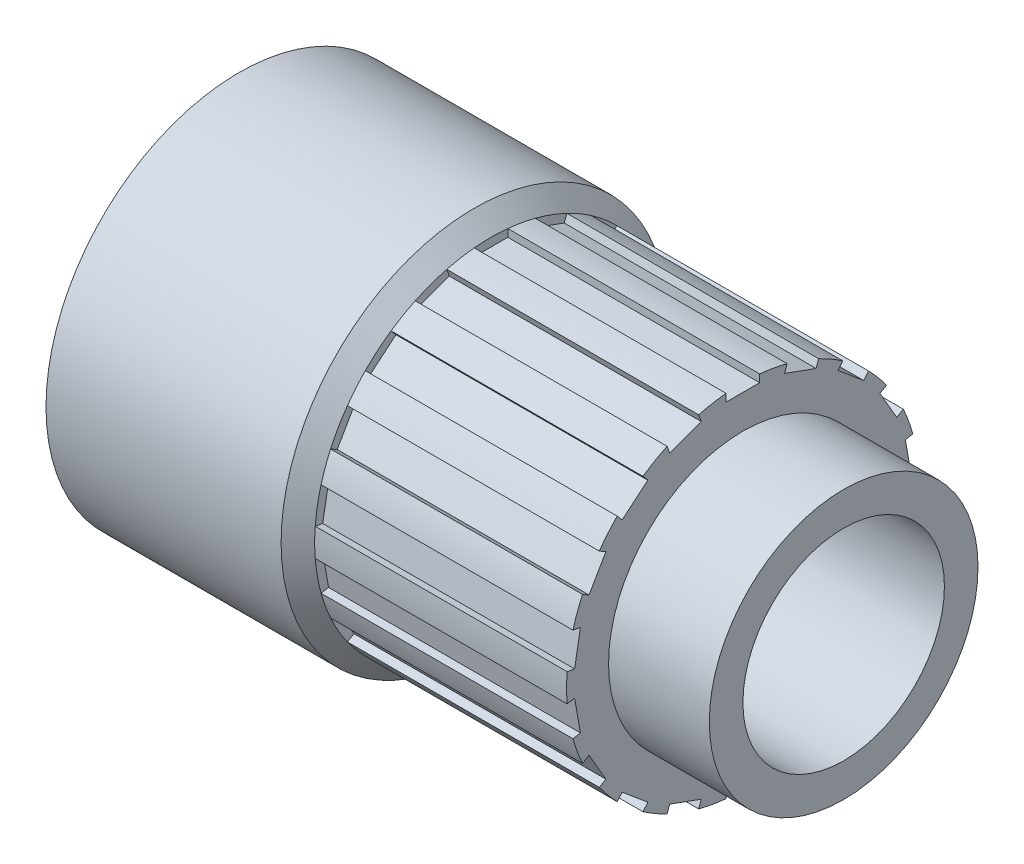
from build123d import *

# Parameters (mm, degrees)
ESQUISSE3_W                  = 1
ESQUISSE3_H                  = 0.5
ENL_V_MAT_EXTRU_1_DEPTH      = 7.5
R_P_TITION_CIRCULAIRE1_COUNT = 18


with BuildPart() as part:
    # Esquisse1 → Base-R_volution (revolve)
    with BuildSketch(Plane.XY, mode=Mode.PRIVATE) as base_r_volution_sk:
        Polygon((0, 4.5), (0, 5.75), (7, 5.75), (7.5, 5.25), (15, 5.25), (15, 4.5), (15, 4), (18, 4), (18, 3), (5.004734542, 3), (5.004734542, 4.5), align=None)
    revolve(base_r_volution_sk.sketch.rotate(Axis((-3.5, 0, 0), (1, 0, 0)), 90), axis=Axis((-3.5, 0, 0), (1, 0, 0)))

    # Esquisse3 → Enl_v. mat.-Extru.1 (cut)
    with BuildSketch(Plane(origin=(15, 0, 0), x_dir=(0, 0, -1), z_dir=(1, 0, 0))):
        with Locations((0, 5.25)):
            Rectangle(ESQUISSE3_W, ESQUISSE3_H)
    enl_v_mat_extru_1 = extrude(amount=-ENL_V_MAT_EXTRU_1_DEPTH, mode=Mode.SUBTRACT)

    # R_p_tition circulaire1: Enl_v. mat.-Extru.1 ×18 about axis
    r_p_tition_circulaire1_axis = Axis((-3.5, 0, 0), (1, 0, 0))
    for i in range(1, R_P_TITION_CIRCULAIRE1_COUNT):
        add(enl_v_mat_extru_1.rotate(r_p_tition_circulaire1_axis, i * 360 / R_P_TITION_CIRCULAIRE1_COUNT), mode=Mode.SUBTRACT)


solid = part.part
